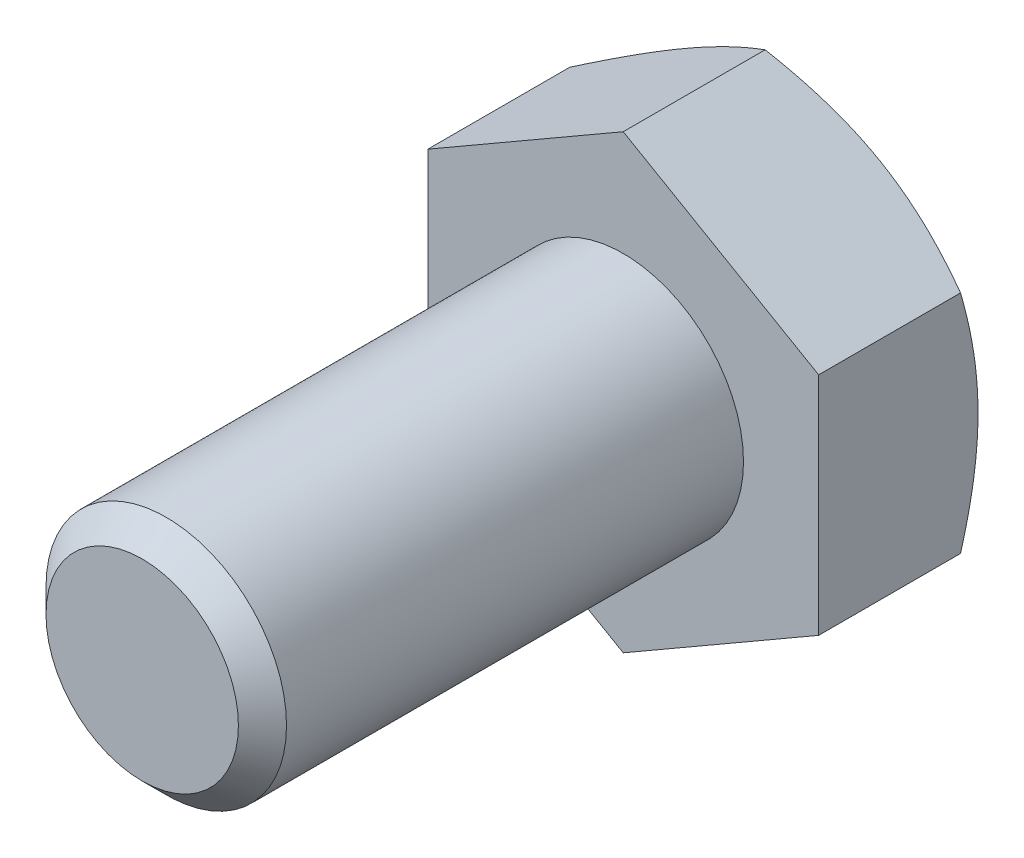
ISO-10303-21;
HEADER;
FILE_DESCRIPTION(('STEP AP214'),'2;1');
FILE_NAME('part.step','',(''),(''),'','','');
FILE_SCHEMA(('AUTOMOTIVE_DESIGN { 1 0 10303 214 1 1 1 1 }'));
ENDSEC;
DATA;
#1=APPLICATION_CONTEXT('core data for automotive mechanical design processes');
#2=APPLICATION_PROTOCOL_DEFINITION('international standard','automotive_design',2000,#1);
#3=PRODUCT_CONTEXT('',#1,'mechanical');
#4=PRODUCT('Part','Part','',(#3));
#5=PRODUCT_RELATED_PRODUCT_CATEGORY('part','',(#4));
#6=PRODUCT_DEFINITION_FORMATION('','',#4);
#7=PRODUCT_DEFINITION_CONTEXT('part definition',#1,'design');
#8=PRODUCT_DEFINITION('design','',#6,#7);
#9=PRODUCT_DEFINITION_SHAPE('','',#8);
#10=(LENGTH_UNIT() NAMED_UNIT(*) SI_UNIT(.MILLI.,.METRE.));
#11=(NAMED_UNIT(*) PLANE_ANGLE_UNIT() SI_UNIT($,.RADIAN.));
#12=(NAMED_UNIT(*) SI_UNIT($,.STERADIAN.) SOLID_ANGLE_UNIT());
#13=UNCERTAINTY_MEASURE_WITH_UNIT(LENGTH_MEASURE(1.E-05),#10,'distance_accuracy_value','');
#14=(GEOMETRIC_REPRESENTATION_CONTEXT(3) GLOBAL_UNCERTAINTY_ASSIGNED_CONTEXT((#13)) GLOBAL_UNIT_ASSIGNED_CONTEXT((#10,
#11,#12)) REPRESENTATION_CONTEXT('',''));
#15=CARTESIAN_POINT('',(0.,0.,0.));
#16=DIRECTION('',(0.,0.,1.));
#17=DIRECTION('',(1.,0.,0.));
#18=AXIS2_PLACEMENT_3D('',#15,#16,#17);
#19=CARTESIAN_POINT('',(0.,0.,16.));
#20=DIRECTION('',(0.,0.,1.));
#21=DIRECTION('',(1.,0.,0.));
#22=AXIS2_PLACEMENT_3D('',#19,#20,#21);
#23=PLANE('',#22);
#24=CARTESIAN_POINT('',(0.,0.,16.));
#25=DIRECTION('',(0.,0.,1.));
#26=DIRECTION('',(1.,0.,0.));
#27=AXIS2_PLACEMENT_3D('',#24,#25,#26);
#28=CIRCLE('',#27,3.2);
#29=CARTESIAN_POINT('',(3.2,0.,16.));
#30=VERTEX_POINT('',#29);
#31=EDGE_CURVE('E203',#30,#30,#28,.T.);
#32=ORIENTED_EDGE('',*,*,#31,.T.);
#33=EDGE_LOOP('',(#32));
#34=FACE_BOUND('',#33,.T.);
#35=ADVANCED_FACE('F29',(#34),#23,.T.);
#36=CARTESIAN_POINT('',(0.,0.,0.));
#37=DIRECTION('',(0.,0.,1.));
#38=DIRECTION('',(1.,0.,0.));
#39=AXIS2_PLACEMENT_3D('',#36,#37,#38);
#40=CYLINDRICAL_SURFACE('',#39,4.);
#41=CARTESIAN_POINT('',(0.,0.,15.2));
#42=DIRECTION('',(0.,0.,1.));
#43=DIRECTION('',(1.,0.,0.));
#44=AXIS2_PLACEMENT_3D('',#41,#42,#43);
#45=CIRCLE('',#44,4.);
#46=CARTESIAN_POINT('',(4.,0.,15.2));
#47=VERTEX_POINT('',#46);
#48=EDGE_CURVE('E205',#47,#47,#45,.F.);
#49=ORIENTED_EDGE('',*,*,#48,.T.);
#50=EDGE_LOOP('',(#49));
#51=FACE_BOUND('',#50,.T.);
#52=CARTESIAN_POINT('',(0.,0.,0.));
#53=DIRECTION('',(0.,0.,1.));
#54=DIRECTION('',(1.,0.,0.));
#55=AXIS2_PLACEMENT_3D('',#52,#53,#54);
#56=CIRCLE('',#55,4.);
#57=CARTESIAN_POINT('',(4.,0.,0.));
#58=VERTEX_POINT('',#57);
#59=EDGE_CURVE('E206',#58,#58,#56,.F.);
#60=ORIENTED_EDGE('',*,*,#59,.F.);
#61=EDGE_LOOP('',(#60));
#62=FACE_BOUND('',#61,.T.);
#63=ADVANCED_FACE('F194',(#51,#62),#40,.T.);
#64=CARTESIAN_POINT('',(0.,0.,16.));
#65=DIRECTION('',(0.,0.,-1.));
#66=DIRECTION('',(-1.,0.,0.));
#67=AXIS2_PLACEMENT_3D('',#64,#65,#66);
#68=CONICAL_SURFACE('',#67,3.2,0.785398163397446);
#69=ORIENTED_EDGE('',*,*,#48,.F.);
#70=EDGE_LOOP('',(#69));
#71=FACE_BOUND('',#70,.T.);
#72=ORIENTED_EDGE('',*,*,#31,.F.);
#73=EDGE_LOOP('',(#72));
#74=FACE_BOUND('',#73,.T.);
#75=ADVANCED_FACE('F199',(#71,#74),#68,.T.);
#76=CARTESIAN_POINT('',(0.,7.50555349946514,-5.3));
#77=DIRECTION('',(0.499999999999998,0.86602540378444,0.));
#78=DIRECTION('',(-0.86602540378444,0.499999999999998,0.));
#79=AXIS2_PLACEMENT_3D('',#76,#77,#78);
#80=PLANE('',#79);
#81=CARTESIAN_POINT('',(-0.000200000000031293,7.50566896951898,-4.71937674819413));
#82=CARTESIAN_POINT('',(0.142677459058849,7.42317863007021,-4.76699557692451));
#83=CARTESIAN_POINT('',(0.286087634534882,7.34038072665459,-4.81245329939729));
#84=CARTESIAN_POINT('',(0.574072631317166,7.17411251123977,-4.89845131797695));
#85=CARTESIAN_POINT('',(0.718647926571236,7.09064192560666,-4.93898949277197));
#86=CARTESIAN_POINT('',(1.15468865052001,6.8388936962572,-5.05242899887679));
#87=CARTESIAN_POINT('',(1.44787528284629,6.66962231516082,-5.11695219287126));
#88=CARTESIAN_POINT('',(1.88662374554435,6.41631077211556,-5.19261341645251));
#89=CARTESIAN_POINT('',(2.03087463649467,6.33302748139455,-5.21416714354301));
#90=CARTESIAN_POINT('',(2.32002821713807,6.16608458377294,-5.25030968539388));
#91=CARTESIAN_POINT('',(2.46493084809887,6.08242501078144,-5.26489911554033));
#92=CARTESIAN_POINT('',(2.7549877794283,5.91496056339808,-5.28674124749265));
#93=CARTESIAN_POINT('',(2.90014160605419,5.83115596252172,-5.29400227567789));
#94=CARTESIAN_POINT('',(3.19057533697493,5.66347396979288,-5.30103969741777));
#95=CARTESIAN_POINT('',(3.33585523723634,5.57959658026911,-5.3008163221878));
#96=CARTESIAN_POINT('',(3.73387594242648,5.34979921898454,-5.28991654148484));
#97=CARTESIAN_POINT('',(3.98648646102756,5.20395446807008,-5.27161818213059));
#98=CARTESIAN_POINT('',(4.49002967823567,4.91323365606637,-5.21359365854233));
#99=CARTESIAN_POINT('',(4.74096060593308,4.76835861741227,-5.17384766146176));
#100=CARTESIAN_POINT('',(5.24551722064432,4.47705272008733,-5.07449409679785));
#101=CARTESIAN_POINT('',(5.49907924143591,4.33065861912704,-5.01446557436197));
#102=CARTESIAN_POINT('',(6.00242193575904,4.04005357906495,-4.87822500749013));
#103=CARTESIAN_POINT('',(6.25220905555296,3.89583891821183,-4.8020449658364));
#104=CARTESIAN_POINT('',(6.5002,3.75266127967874,-4.71937674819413));
#105=B_SPLINE_CURVE_WITH_KNOTS('',3,(#81,#82,#83,#84,#85,#86,#87,#88,#89,#90,#91,#92,#93,#94,
#95,#96,#97,#98,#99,#100,#101,#102,#103,#104),.UNSPECIFIED.,.F.,.F.,(4,2,2,2,2,2,2,2,2,2,2,4),
(0.,0.515105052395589,1.03043143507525,2.06322554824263,2.56697389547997,3.07067772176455,
3.57380860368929,4.07692394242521,4.95279354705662,5.82947446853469,6.72559912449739,
7.61996451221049),.UNSPECIFIED.);
#106=CARTESIAN_POINT('',(0.,7.50555349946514,-4.71944341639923));
#107=VERTEX_POINT('',#106);
#108=CARTESIAN_POINT('',(3.24999999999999,5.62916512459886,-5.3));
#109=VERTEX_POINT('',#108);
#110=EDGE_CURVE('E239',#107,#109,#105,.T.);
#111=ORIENTED_EDGE('',*,*,#110,.F.);
#112=DIRECTION('',(0.,0.,1.));
#113=VECTOR('',#112,1.);
#114=CARTESIAN_POINT('',(0.,7.50555349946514,-5.3));
#115=LINE('',#114,#113);
#116=CARTESIAN_POINT('',(0.,7.50555349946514,0.));
#117=VERTEX_POINT('',#116);
#118=EDGE_CURVE('E213',#107,#117,#115,.T.);
#119=ORIENTED_EDGE('',*,*,#118,.T.);
#120=DIRECTION('',(-0.86602540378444,0.499999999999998,0.));
#121=VECTOR('',#120,1.);
#122=CARTESIAN_POINT('',(0.,7.50555349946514,0.));
#123=LINE('',#122,#121);
#124=CARTESIAN_POINT('',(6.5,3.75277674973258,0.));
#125=VERTEX_POINT('',#124);
#126=EDGE_CURVE('E237',#125,#117,#123,.T.);
#127=ORIENTED_EDGE('',*,*,#126,.F.);
#128=DIRECTION('',(0.,0.,1.));
#129=VECTOR('',#128,1.);
#130=CARTESIAN_POINT('',(6.5,3.75277674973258,-5.3));
#131=LINE('',#130,#129);
#132=CARTESIAN_POINT('',(6.5,3.75277674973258,-4.71944341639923));
#133=VERTEX_POINT('',#132);
#134=EDGE_CURVE('E210',#133,#125,#131,.T.);
#135=ORIENTED_EDGE('',*,*,#134,.F.);
#136=EDGE_CURVE('E169',#109,#133,#105,.T.);
#137=ORIENTED_EDGE('',*,*,#136,.F.);
#138=EDGE_LOOP('',(#111,#119,#127,#135,#137));
#139=FACE_BOUND('',#138,.T.);
#140=ADVANCED_FACE('F179',(#139),#80,.T.);
#141=CARTESIAN_POINT('',(6.5,-3.75277674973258,-5.3));
#142=DIRECTION('',(1.,0.,0.));
#143=DIRECTION('',(0.,0.,-1.));
#144=AXIS2_PLACEMENT_3D('',#141,#142,#143);
#145=PLANE('',#144);
#146=CARTESIAN_POINT('',(6.5,-10.2428264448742,-2.04883753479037));
#147=CARTESIAN_POINT('',(6.5,-9.95749123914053,-2.18789595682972));
#148=CARTESIAN_POINT('',(6.5,-9.67151814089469,-2.32566707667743));
#149=CARTESIAN_POINT('',(6.5,-9.09795746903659,-2.59791370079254));
#150=CARTESIAN_POINT('',(6.5,-8.81036966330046,-2.73238871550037));
#151=CARTESIAN_POINT('',(6.5,-8.23183597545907,-2.99796413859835));
#152=CARTESIAN_POINT('',(6.5,-7.94088042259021,-3.12904355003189));
#153=CARTESIAN_POINT('',(6.5,-7.35671087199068,-3.38604980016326));
#154=CARTESIAN_POINT('',(6.5,-7.06349697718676,-3.51197687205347));
#155=CARTESIAN_POINT('',(6.5,-6.46434920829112,-3.7614858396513));
#156=CARTESIAN_POINT('',(6.5,-6.15832132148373,-3.88484316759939));
#157=CARTESIAN_POINT('',(6.5,-5.54274557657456,-4.12260875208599));
#158=CARTESIAN_POINT('',(6.5,-5.23319733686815,-4.2370160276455));
#159=CARTESIAN_POINT('',(6.5,-4.61061796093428,-4.45399730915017));
#160=CARTESIAN_POINT('',(6.5,-4.29759477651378,-4.55659391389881));
#161=CARTESIAN_POINT('',(6.5,-3.66705774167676,-4.74676876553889));
#162=CARTESIAN_POINT('',(6.5,-3.34954528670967,-4.83435157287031));
#163=CARTESIAN_POINT('',(6.5,-2.71162315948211,-4.98994277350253));
#164=CARTESIAN_POINT('',(6.5,-2.3912406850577,-5.05806094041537));
#165=CARTESIAN_POINT('',(6.5,-1.74628166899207,-5.17096432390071));
#166=CARTESIAN_POINT('',(6.5,-1.4217055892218,-5.21575208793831));
#167=CARTESIAN_POINT('',(6.5,-0.935153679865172,-5.26247031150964));
#168=CARTESIAN_POINT('',(6.5,-0.77412070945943,-5.27461755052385));
#169=CARTESIAN_POINT('',(6.5,-0.451677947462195,-5.29209027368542));
#170=CARTESIAN_POINT('',(6.5,-0.290268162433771,-5.29741587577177));
#171=CARTESIAN_POINT('',(6.5,0.0326315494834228,-5.30111032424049));
#172=CARTESIAN_POINT('',(6.5,0.194121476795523,-5.29947913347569));
#173=CARTESIAN_POINT('',(6.5,0.51688566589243,-5.28930353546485));
#174=CARTESIAN_POINT('',(6.5,0.678159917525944,-5.2807588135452));
#175=CARTESIAN_POINT('',(6.5,1.06087214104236,-5.25246253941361));
#176=CARTESIAN_POINT('',(6.5,1.28209274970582,-5.22970222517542));
#177=CARTESIAN_POINT('',(6.5,1.72298724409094,-5.17237790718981));
#178=CARTESIAN_POINT('',(6.5,1.94266093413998,-5.13781243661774));
#179=CARTESIAN_POINT('',(6.5,2.59905068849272,-5.01823337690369));
#180=CARTESIAN_POINT('',(6.5,3.03292018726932,-4.91735524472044));
#181=CARTESIAN_POINT('',(6.5,3.68203059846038,-4.74117763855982));
#182=CARTESIAN_POINT('',(6.5,3.90060192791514,-4.67743243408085));
#183=CARTESIAN_POINT('',(6.5,4.33562456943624,-4.54301317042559));
#184=CARTESIAN_POINT('',(6.5,4.55207586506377,-4.47233905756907));
#185=CARTESIAN_POINT('',(6.5,4.98292314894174,-4.3252213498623));
#186=CARTESIAN_POINT('',(6.5,5.19731969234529,-4.24877936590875));
#187=CARTESIAN_POINT('',(6.5,5.62431367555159,-4.09105605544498));
#188=CARTESIAN_POINT('',(6.5,5.8369111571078,-4.00977484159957));
#189=CARTESIAN_POINT('',(6.5,6.41107024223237,-3.78396124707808));
#190=CARTESIAN_POINT('',(6.5,6.77109993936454,-3.63553740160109));
#191=CARTESIAN_POINT('',(6.5,7.48742894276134,-3.32991367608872));
#192=CARTESIAN_POINT('',(6.5,7.84372782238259,-3.17271280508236));
#193=CARTESIAN_POINT('',(6.5,8.55345570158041,-2.85162072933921));
#194=CARTESIAN_POINT('',(6.5,8.90688352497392,-2.68772693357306));
#195=CARTESIAN_POINT('',(6.5,9.61131133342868,-2.35485675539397));
#196=CARTESIAN_POINT('',(6.5,9.96231141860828,-2.18588058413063));
#197=CARTESIAN_POINT('',(6.5,10.6629371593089,-1.84367823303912));
#198=CARTESIAN_POINT('',(6.5,11.0125596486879,-1.67044558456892));
#199=CARTESIAN_POINT('',(6.5,11.7102232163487,-1.32082260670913));
#200=CARTESIAN_POINT('',(6.5,12.058264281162,-1.14443225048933));
#201=CARTESIAN_POINT('',(6.5,12.7529700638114,-0.78915631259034));
#202=CARTESIAN_POINT('',(6.5,13.099635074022,-0.610271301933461));
#203=CARTESIAN_POINT('',(6.5,13.7918918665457,-0.250435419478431));
#204=CARTESIAN_POINT('',(6.5,14.1374836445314,-0.0694845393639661));
#205=CARTESIAN_POINT('',(6.5,15.099399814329,0.437179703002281));
#206=CARTESIAN_POINT('',(6.5,15.7147468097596,0.764748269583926));
#207=CARTESIAN_POINT('',(6.5,16.9433793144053,1.42381233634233));
#208=CARTESIAN_POINT('',(6.5,17.5566646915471,1.75530808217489));
#209=CARTESIAN_POINT('',(6.5,18.7795711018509,2.42008717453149));
#210=CARTESIAN_POINT('',(6.5,19.389197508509,2.75336064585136));
#211=CARTESIAN_POINT('',(6.5,20.6071616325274,3.42213981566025));
#212=CARTESIAN_POINT('',(6.5,21.2154994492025,3.75764533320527));
#213=CARTESIAN_POINT('',(6.5,21.8233856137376,4.09396124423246));
#214=B_SPLINE_CURVE_WITH_KNOTS('',3,(#146,#147,#148,#149,#150,#151,#152,#153,#154,#155,#156,
#157,#158,#159,#160,#161,#162,#163,#164,#165,#166,#167,#168,#169,#170,#171,#172,#173,#174,#175,
#176,#177,#178,#179,#180,#181,#182,#183,#184,#185,#186,#187,#188,#189,#190,#191,#192,#193,#194,
#195,#196,#197,#198,#199,#200,#201,#202,#203,#204,#205,#206,#207,#208,#209,#210,#211,#212,#213),
.UNSPECIFIED.,.F.,.F.,(4,2,2,2,2,2,2,2,2,2,2,2,2,2,2,2,2,2,2,2,2,2,2,2,2,2,2,2,2,2,2,2,2,4),(0.,
0.952261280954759,1.90466315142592,2.8619801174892,3.81925370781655,4.8090096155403,
5.798873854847,6.78681142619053,7.7744483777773,8.75640022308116,9.73824482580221,
10.2225937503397,10.7069343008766,11.1912774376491,11.6756426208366,12.3424346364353,
13.0093095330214,14.3437044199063,15.0266742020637,15.7096492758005,16.3924343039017,
17.0752034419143,18.2433007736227,19.4115302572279,20.580216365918,21.748853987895,
22.9193933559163,24.0899426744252,25.2602283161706,26.4305186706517,28.5218066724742,
30.6132261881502,32.6975528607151,34.7817125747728),.UNSPECIFIED.);
#215=CARTESIAN_POINT('',(6.5,0.,-5.3));
#216=VERTEX_POINT('',#215);
#217=EDGE_CURVE('E167',#133,#216,#214,.F.);
#218=ORIENTED_EDGE('',*,*,#217,.F.);
#219=ORIENTED_EDGE('',*,*,#134,.T.);
#220=DIRECTION('',(0.,1.,0.));
#221=VECTOR('',#220,1.);
#222=CARTESIAN_POINT('',(6.5,-3.75277674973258,0.));
#223=LINE('',#222,#221);
#224=CARTESIAN_POINT('',(6.5,-3.75277674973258,0.));
#225=VERTEX_POINT('',#224);
#226=EDGE_CURVE('E215',#225,#125,#223,.T.);
#227=ORIENTED_EDGE('',*,*,#226,.F.);
#228=DIRECTION('',(0.,0.,1.));
#229=VECTOR('',#228,1.);
#230=CARTESIAN_POINT('',(6.5,-3.75277674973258,-5.3));
#231=LINE('',#230,#229);
#232=CARTESIAN_POINT('',(6.5,-3.75277674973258,-4.71944341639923));
#233=VERTEX_POINT('',#232);
#234=EDGE_CURVE('E221',#233,#225,#231,.T.);
#235=ORIENTED_EDGE('',*,*,#234,.F.);
#236=EDGE_CURVE('E162',#216,#233,#214,.F.);
#237=ORIENTED_EDGE('',*,*,#236,.F.);
#238=EDGE_LOOP('',(#218,#219,#227,#235,#237));
#239=FACE_BOUND('',#238,.T.);
#240=ADVANCED_FACE('F175',(#239),#145,.T.);
#241=CARTESIAN_POINT('',(0.,-7.50555349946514,-5.3));
#242=DIRECTION('',(0.499999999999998,-0.86602540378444,0.));
#243=DIRECTION('',(0.86602540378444,0.499999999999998,0.));
#244=AXIS2_PLACEMENT_3D('',#241,#242,#243);
#245=PLANE('',#244);
#246=CARTESIAN_POINT('',(6.5002,-3.75266127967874,-4.71937674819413));
#247=CARTESIAN_POINT('',(6.35732254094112,-3.83515161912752,-4.76699557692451));
#248=CARTESIAN_POINT('',(6.21391236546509,-3.91794952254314,-4.81245329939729));
#249=CARTESIAN_POINT('',(5.92592736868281,-4.08421773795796,-4.89845131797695));
#250=CARTESIAN_POINT('',(5.78135207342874,-4.16768832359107,-4.93898949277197));
#251=CARTESIAN_POINT('',(5.34531134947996,-4.41943655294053,-5.05242899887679));
#252=CARTESIAN_POINT('',(5.05212471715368,-4.58870793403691,-5.11695219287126));
#253=CARTESIAN_POINT('',(4.61337625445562,-4.84201947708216,-5.19261341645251));
#254=CARTESIAN_POINT('',(4.4691253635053,-4.92530276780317,-5.21416714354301));
#255=CARTESIAN_POINT('',(4.1799717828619,-5.09224566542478,-5.25030968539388));
#256=CARTESIAN_POINT('',(4.0350691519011,-5.17590523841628,-5.26489911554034));
#257=CARTESIAN_POINT('',(3.74501222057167,-5.34336968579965,-5.28674124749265));
#258=CARTESIAN_POINT('',(3.59985839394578,-5.42717428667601,-5.29400227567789));
#259=CARTESIAN_POINT('',(3.30942466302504,-5.59485627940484,-5.30103969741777));
#260=CARTESIAN_POINT('',(3.16414476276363,-5.67873366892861,-5.3008163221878));
#261=CARTESIAN_POINT('',(2.76612405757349,-5.90853103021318,-5.28991654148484));
#262=CARTESIAN_POINT('',(2.51351353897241,-6.05437578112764,-5.27161818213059));
#263=CARTESIAN_POINT('',(2.0099703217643,-6.34509659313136,-5.21359365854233));
#264=CARTESIAN_POINT('',(1.7590393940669,-6.48997163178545,-5.17384766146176));
#265=CARTESIAN_POINT('',(1.25448277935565,-6.78127752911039,-5.07449409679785));
#266=CARTESIAN_POINT('',(1.00092075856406,-6.92767163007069,-5.01446557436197));
#267=CARTESIAN_POINT('',(0.497578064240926,-7.21827667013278,-4.87822500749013));
#268=CARTESIAN_POINT('',(0.247790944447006,-7.3624913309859,-4.8020449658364));
#269=CARTESIAN_POINT('',(-0.000200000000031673,-7.50566896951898,-4.71937674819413));
#270=B_SPLINE_CURVE_WITH_KNOTS('',3,(#246,#247,#248,#249,#250,#251,#252,#253,#254,#255,#256,
#257,#258,#259,#260,#261,#262,#263,#264,#265,#266,#267,#268,#269),.UNSPECIFIED.,.F.,.F.,(4,2,2,
2,2,2,2,2,2,2,2,4),(0.,0.515105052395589,1.03043143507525,2.06322554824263,2.56697389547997,
3.07067772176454,3.57380860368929,4.07692394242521,4.95279354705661,5.82947446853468,
6.72559912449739,7.61996451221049),.UNSPECIFIED.);
#271=CARTESIAN_POINT('',(3.24999999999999,-5.62916512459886,-5.3));
#272=VERTEX_POINT('',#271);
#273=EDGE_CURVE('E168',#233,#272,#270,.T.);
#274=ORIENTED_EDGE('',*,*,#273,.F.);
#275=ORIENTED_EDGE('',*,*,#234,.T.);
#276=DIRECTION('',(0.86602540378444,0.499999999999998,0.));
#277=VECTOR('',#276,1.);
#278=CARTESIAN_POINT('',(0.,-7.50555349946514,0.));
#279=LINE('',#278,#277);
#280=CARTESIAN_POINT('',(0.,-7.50555349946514,0.));
#281=VERTEX_POINT('',#280);
#282=EDGE_CURVE('E226',#281,#225,#279,.T.);
#283=ORIENTED_EDGE('',*,*,#282,.F.);
#284=DIRECTION('',(0.,0.,1.));
#285=VECTOR('',#284,1.);
#286=CARTESIAN_POINT('',(0.,-7.50555349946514,-5.3));
#287=LINE('',#286,#285);
#288=CARTESIAN_POINT('',(0.,-7.50555349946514,-4.71944341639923));
#289=VERTEX_POINT('',#288);
#290=EDGE_CURVE('E219',#289,#281,#287,.T.);
#291=ORIENTED_EDGE('',*,*,#290,.F.);
#292=EDGE_CURVE('E156',#272,#289,#270,.T.);
#293=ORIENTED_EDGE('',*,*,#292,.F.);
#294=EDGE_LOOP('',(#274,#275,#283,#291,#293));
#295=FACE_BOUND('',#294,.T.);
#296=ADVANCED_FACE('F178',(#295),#245,.T.);
#297=CARTESIAN_POINT('',(0.,-7.50555349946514,-5.3));
#298=DIRECTION('',(-0.500000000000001,-0.866025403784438,0.));
#299=DIRECTION('',(0.866025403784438,-0.500000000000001,0.));
#300=AXIS2_PLACEMENT_3D('',#297,#298,#299);
#301=PLANE('',#300);
#302=CARTESIAN_POINT('',(0.000199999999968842,-7.50566896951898,-4.71937674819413));
#303=CARTESIAN_POINT('',(-0.142677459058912,-7.42317863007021,-4.76699557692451));
#304=CARTESIAN_POINT('',(-0.286087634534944,-7.34038072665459,-4.81245329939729));
#305=CARTESIAN_POINT('',(-0.574072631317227,-7.17411251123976,-4.89845131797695));
#306=CARTESIAN_POINT('',(-0.718647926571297,-7.09064192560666,-4.93898949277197));
#307=CARTESIAN_POINT('',(-1.15468865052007,-6.83889369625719,-5.05242899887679));
#308=CARTESIAN_POINT('',(-1.44787528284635,-6.66962231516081,-5.11695219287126));
#309=CARTESIAN_POINT('',(-1.88662374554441,-6.41631077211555,-5.1926134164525));
#310=CARTESIAN_POINT('',(-2.03087463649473,-6.33302748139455,-5.21416714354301));
#311=CARTESIAN_POINT('',(-2.32002821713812,-6.16608458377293,-5.25030968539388));
#312=CARTESIAN_POINT('',(-2.46493084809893,-6.08242501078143,-5.26489911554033));
#313=CARTESIAN_POINT('',(-2.75498777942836,-5.91496056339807,-5.28674124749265));
#314=CARTESIAN_POINT('',(-2.90014160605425,-5.8311559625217,-5.29400227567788));
#315=CARTESIAN_POINT('',(-3.19057533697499,-5.66347396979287,-5.30103969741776));
#316=CARTESIAN_POINT('',(-3.3358552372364,-5.5795965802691,-5.30081632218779));
#317=CARTESIAN_POINT('',(-3.73387594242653,-5.34979921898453,-5.28991654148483));
#318=CARTESIAN_POINT('',(-3.9864864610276,-5.20395446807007,-5.27161818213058));
#319=CARTESIAN_POINT('',(-4.49002967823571,-4.91323365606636,-5.21359365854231));
#320=CARTESIAN_POINT('',(-4.74096060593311,-4.76835861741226,-5.17384766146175));
#321=CARTESIAN_POINT('',(-5.24551722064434,-4.47705272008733,-5.07449409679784));
#322=CARTESIAN_POINT('',(-5.49907924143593,-4.33065861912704,-5.01446557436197));
#323=CARTESIAN_POINT('',(-6.00242193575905,-4.04005357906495,-4.87822500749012));
#324=CARTESIAN_POINT('',(-6.25220905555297,-3.89583891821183,-4.8020449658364));
#325=CARTESIAN_POINT('',(-6.5002,-3.75266127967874,-4.71937674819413));
#326=B_SPLINE_CURVE_WITH_KNOTS('',3,(#302,#303,#304,#305,#306,#307,#308,#309,#310,#311,#312,
#313,#314,#315,#316,#317,#318,#319,#320,#321,#322,#323,#324,#325),.UNSPECIFIED.,.F.,.F.,(4,2,2,
2,2,2,2,2,2,2,2,4),(0.,0.515105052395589,1.03043143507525,2.06322554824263,2.56697389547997,
3.07067772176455,3.57380860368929,4.07692394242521,4.9527935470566,5.82947446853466,
6.72559912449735,7.61996451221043),.UNSPECIFIED.);
#327=CARTESIAN_POINT('',(-3.25000000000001,-5.62916512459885,-5.3));
#328=VERTEX_POINT('',#327);
#329=EDGE_CURVE('E258',#289,#328,#326,.T.);
#330=ORIENTED_EDGE('',*,*,#329,.F.);
#331=ORIENTED_EDGE('',*,*,#290,.T.);
#332=DIRECTION('',(0.866025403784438,-0.500000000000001,0.));
#333=VECTOR('',#332,1.);
#334=CARTESIAN_POINT('',(0.,-7.50555349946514,0.));
#335=LINE('',#334,#333);
#336=CARTESIAN_POINT('',(-6.5,-3.75277674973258,0.));
#337=VERTEX_POINT('',#336);
#338=EDGE_CURVE('E229',#337,#281,#335,.T.);
#339=ORIENTED_EDGE('',*,*,#338,.F.);
#340=DIRECTION('',(0.,0.,1.));
#341=VECTOR('',#340,1.);
#342=CARTESIAN_POINT('',(-6.5,-3.75277674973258,-5.3));
#343=LINE('',#342,#341);
#344=CARTESIAN_POINT('',(-6.5,-3.75277674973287,-4.71944341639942));
#345=VERTEX_POINT('',#344);
#346=EDGE_CURVE('E217',#345,#337,#343,.T.);
#347=ORIENTED_EDGE('',*,*,#346,.F.);
#348=EDGE_CURVE('E105',#328,#345,#326,.T.);
#349=ORIENTED_EDGE('',*,*,#348,.F.);
#350=EDGE_LOOP('',(#330,#331,#339,#347,#349));
#351=FACE_BOUND('',#350,.T.);
#352=ADVANCED_FACE('F183',(#351),#301,.T.);
#353=CARTESIAN_POINT('',(-6.5,-3.75277674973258,-5.3));
#354=DIRECTION('',(-1.,0.,0.));
#355=DIRECTION('',(0.,0.,1.));
#356=AXIS2_PLACEMENT_3D('',#353,#354,#355);
#357=PLANE('',#356);
#358=CARTESIAN_POINT('',(-6.5,-10.2428264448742,-2.04883753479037));
#359=CARTESIAN_POINT('',(-6.5,-9.95749123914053,-2.18789595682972));
#360=CARTESIAN_POINT('',(-6.5,-9.67151814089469,-2.32566707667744));
#361=CARTESIAN_POINT('',(-6.5,-9.09795746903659,-2.59791370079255));
#362=CARTESIAN_POINT('',(-6.5,-8.81036966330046,-2.73238871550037));
#363=CARTESIAN_POINT('',(-6.5,-8.23183597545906,-2.99796413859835));
#364=CARTESIAN_POINT('',(-6.5,-7.94088042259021,-3.12904355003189));
#365=CARTESIAN_POINT('',(-6.5,-7.35671087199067,-3.38604980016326));
#366=CARTESIAN_POINT('',(-6.5,-7.06349697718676,-3.51197687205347));
#367=CARTESIAN_POINT('',(-6.5,-6.46434920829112,-3.7614858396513));
#368=CARTESIAN_POINT('',(-6.5,-6.15832132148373,-3.8848431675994));
#369=CARTESIAN_POINT('',(-6.5,-5.54274557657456,-4.12260875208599));
#370=CARTESIAN_POINT('',(-6.5,-5.23319733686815,-4.2370160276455));
#371=CARTESIAN_POINT('',(-6.5,-4.61061796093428,-4.45399730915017));
#372=CARTESIAN_POINT('',(-6.5,-4.29759477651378,-4.55659391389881));
#373=CARTESIAN_POINT('',(-6.5,-3.66705774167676,-4.74676876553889));
#374=CARTESIAN_POINT('',(-6.5,-3.34954528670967,-4.83435157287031));
#375=CARTESIAN_POINT('',(-6.5,-2.71162315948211,-4.98994277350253));
#376=CARTESIAN_POINT('',(-6.5,-2.3912406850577,-5.05806094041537));
#377=CARTESIAN_POINT('',(-6.5,-1.74628166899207,-5.17096432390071));
#378=CARTESIAN_POINT('',(-6.5,-1.4217055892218,-5.21575208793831));
#379=CARTESIAN_POINT('',(-6.5,-0.935153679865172,-5.26247031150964));
#380=CARTESIAN_POINT('',(-6.5,-0.774120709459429,-5.27461755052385));
#381=CARTESIAN_POINT('',(-6.5,-0.451677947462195,-5.29209027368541));
#382=CARTESIAN_POINT('',(-6.5,-0.290268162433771,-5.29741587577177));
#383=CARTESIAN_POINT('',(-6.5,0.0326315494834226,-5.30111032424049));
#384=CARTESIAN_POINT('',(-6.5,0.194121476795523,-5.29947913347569));
#385=CARTESIAN_POINT('',(-6.5,0.51688566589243,-5.28930353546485));
#386=CARTESIAN_POINT('',(-6.5,0.678159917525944,-5.2807588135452));
#387=CARTESIAN_POINT('',(-6.5,1.06087214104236,-5.25246253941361));
#388=CARTESIAN_POINT('',(-6.5,1.28209274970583,-5.22970222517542));
#389=CARTESIAN_POINT('',(-6.5,1.72298724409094,-5.17237790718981));
#390=CARTESIAN_POINT('',(-6.5,1.94266093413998,-5.13781243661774));
#391=CARTESIAN_POINT('',(-6.5,2.59905068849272,-5.01823337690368));
#392=CARTESIAN_POINT('',(-6.5,3.03292018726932,-4.91735524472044));
#393=CARTESIAN_POINT('',(-6.5,3.68203059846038,-4.74117763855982));
#394=CARTESIAN_POINT('',(-6.5,3.90060192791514,-4.67743243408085));
#395=CARTESIAN_POINT('',(-6.5,4.33562456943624,-4.54301317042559));
#396=CARTESIAN_POINT('',(-6.5,4.55207586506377,-4.47233905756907));
#397=CARTESIAN_POINT('',(-6.5,4.98292314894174,-4.3252213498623));
#398=CARTESIAN_POINT('',(-6.5,5.19731969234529,-4.24877936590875));
#399=CARTESIAN_POINT('',(-6.5,5.62431367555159,-4.09105605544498));
#400=CARTESIAN_POINT('',(-6.5,5.8369111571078,-4.00977484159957));
#401=CARTESIAN_POINT('',(-6.5,6.41107024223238,-3.78396124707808));
#402=CARTESIAN_POINT('',(-6.5,6.77109993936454,-3.63553740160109));
#403=CARTESIAN_POINT('',(-6.5,7.48742894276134,-3.32991367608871));
#404=CARTESIAN_POINT('',(-6.5,7.8437278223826,-3.17271280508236));
#405=CARTESIAN_POINT('',(-6.5,8.55345570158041,-2.85162072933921));
#406=CARTESIAN_POINT('',(-6.5,8.90688352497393,-2.68772693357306));
#407=CARTESIAN_POINT('',(-6.5,9.61131133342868,-2.35485675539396));
#408=CARTESIAN_POINT('',(-6.5,9.96231141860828,-2.18588058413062));
#409=CARTESIAN_POINT('',(-6.5,10.6629371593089,-1.84367823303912));
#410=CARTESIAN_POINT('',(-6.5,11.0125596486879,-1.67044558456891));
#411=CARTESIAN_POINT('',(-6.5,11.7102232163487,-1.32082260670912));
#412=CARTESIAN_POINT('',(-6.5,12.058264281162,-1.14443225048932));
#413=CARTESIAN_POINT('',(-6.5,12.7529700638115,-0.789156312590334));
#414=CARTESIAN_POINT('',(-6.5,13.099635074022,-0.610271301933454));
#415=CARTESIAN_POINT('',(-6.5,13.7918918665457,-0.250435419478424));
#416=CARTESIAN_POINT('',(-6.5,14.1374836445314,-0.0694845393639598));
#417=CARTESIAN_POINT('',(-6.5,15.099399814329,0.437179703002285));
#418=CARTESIAN_POINT('',(-6.5,15.7147468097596,0.76474826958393));
#419=CARTESIAN_POINT('',(-6.5,16.9433793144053,1.42381233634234));
#420=CARTESIAN_POINT('',(-6.5,17.5566646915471,1.7553080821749));
#421=CARTESIAN_POINT('',(-6.5,18.7795711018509,2.4200871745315));
#422=CARTESIAN_POINT('',(-6.5,19.389197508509,2.75336064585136));
#423=CARTESIAN_POINT('',(-6.5,20.6071616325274,3.42213981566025));
#424=CARTESIAN_POINT('',(-6.5,21.2154994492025,3.75764533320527));
#425=CARTESIAN_POINT('',(-6.5,21.8233856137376,4.09396124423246));
#426=B_SPLINE_CURVE_WITH_KNOTS('',3,(#358,#359,#360,#361,#362,#363,#364,#365,#366,#367,#368,
#369,#370,#371,#372,#373,#374,#375,#376,#377,#378,#379,#380,#381,#382,#383,#384,#385,#386,#387,
#388,#389,#390,#391,#392,#393,#394,#395,#396,#397,#398,#399,#400,#401,#402,#403,#404,#405,#406,
#407,#408,#409,#410,#411,#412,#413,#414,#415,#416,#417,#418,#419,#420,#421,#422,#423,#424,#425),
.UNSPECIFIED.,.F.,.F.,(4,2,2,2,2,2,2,2,2,2,2,2,2,2,2,2,2,2,2,2,2,2,2,2,2,2,2,2,2,2,2,2,2,4),(0.,
0.952261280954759,1.90466315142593,2.8619801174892,3.81925370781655,4.8090096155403,
5.798873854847,6.78681142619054,7.7744483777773,8.75640022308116,9.73824482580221,
10.2225937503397,10.7069343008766,11.1912774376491,11.6756426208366,12.3424346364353,
13.0093095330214,14.3437044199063,15.0266742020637,15.7096492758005,16.3924343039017,
17.0752034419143,18.2433007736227,19.4115302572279,20.580216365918,21.748853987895,
22.9193933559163,24.0899426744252,25.2602283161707,26.4305186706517,28.5218066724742,
30.6132261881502,32.6975528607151,34.7817125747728),.UNSPECIFIED.);
#427=CARTESIAN_POINT('',(-6.5,0.,-5.3));
#428=VERTEX_POINT('',#427);
#429=EDGE_CURVE('E100',#345,#428,#426,.T.);
#430=ORIENTED_EDGE('',*,*,#429,.F.);
#431=ORIENTED_EDGE('',*,*,#346,.T.);
#432=DIRECTION('',(0.,-1.,0.));
#433=VECTOR('',#432,1.);
#434=CARTESIAN_POINT('',(-6.5,-3.75277674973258,0.));
#435=LINE('',#434,#433);
#436=CARTESIAN_POINT('',(-6.5,3.75277674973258,0.));
#437=VERTEX_POINT('',#436);
#438=EDGE_CURVE('E232',#437,#337,#435,.T.);
#439=ORIENTED_EDGE('',*,*,#438,.F.);
#440=DIRECTION('',(0.,0.,1.));
#441=VECTOR('',#440,1.);
#442=CARTESIAN_POINT('',(-6.5,3.75277674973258,-5.3));
#443=LINE('',#442,#441);
#444=CARTESIAN_POINT('',(-6.5,3.75277674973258,-4.71944341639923));
#445=VERTEX_POINT('',#444);
#446=EDGE_CURVE('E126',#445,#437,#443,.T.);
#447=ORIENTED_EDGE('',*,*,#446,.F.);
#448=EDGE_CURVE('E109',#428,#445,#426,.T.);
#449=ORIENTED_EDGE('',*,*,#448,.F.);
#450=EDGE_LOOP('',(#430,#431,#439,#447,#449));
#451=FACE_BOUND('',#450,.T.);
#452=ADVANCED_FACE('F124',(#451),#357,.T.);
#453=CARTESIAN_POINT('',(-6.5,3.75277674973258,-5.3));
#454=DIRECTION('',(-0.500000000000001,0.866025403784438,0.));
#455=DIRECTION('',(-0.866025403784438,-0.500000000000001,0.));
#456=AXIS2_PLACEMENT_3D('',#453,#454,#455);
#457=PLANE('',#456);
#458=CARTESIAN_POINT('',(-6.5002,3.75266127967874,-4.71937674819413));
#459=CARTESIAN_POINT('',(-6.35732254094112,3.83515161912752,-4.76699557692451));
#460=CARTESIAN_POINT('',(-6.21391236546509,3.91794952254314,-4.81245329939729));
#461=CARTESIAN_POINT('',(-5.92592736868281,4.08421773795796,-4.89845131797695));
#462=CARTESIAN_POINT('',(-5.78135207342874,4.16768832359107,-4.93898949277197));
#463=CARTESIAN_POINT('',(-5.34531134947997,4.41943655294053,-5.05242899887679));
#464=CARTESIAN_POINT('',(-5.05212471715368,4.58870793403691,-5.11695219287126));
#465=CARTESIAN_POINT('',(-4.61337625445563,4.84201947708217,-5.1926134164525));
#466=CARTESIAN_POINT('',(-4.46912536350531,4.92530276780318,-5.21416714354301));
#467=CARTESIAN_POINT('',(-4.17997178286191,5.09224566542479,-5.25030968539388));
#468=CARTESIAN_POINT('',(-4.03506915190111,5.17590523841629,-5.26489911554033));
#469=CARTESIAN_POINT('',(-3.74501222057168,5.34336968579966,-5.28674124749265));
#470=CARTESIAN_POINT('',(-3.59985839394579,5.42717428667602,-5.29400227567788));
#471=CARTESIAN_POINT('',(-3.30942466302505,5.59485627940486,-5.30103969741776));
#472=CARTESIAN_POINT('',(-3.16414476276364,5.67873366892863,-5.30081632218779));
#473=CARTESIAN_POINT('',(-2.76612405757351,5.90853103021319,-5.28991654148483));
#474=CARTESIAN_POINT('',(-2.51351353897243,6.05437578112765,-5.27161818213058));
#475=CARTESIAN_POINT('',(-2.00997032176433,6.34509659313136,-5.21359365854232));
#476=CARTESIAN_POINT('',(-1.75903939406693,6.48997163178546,-5.17384766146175));
#477=CARTESIAN_POINT('',(-1.25448277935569,6.7812775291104,-5.07449409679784));
#478=CARTESIAN_POINT('',(-1.00092075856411,6.92767163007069,-5.01446557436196));
#479=CARTESIAN_POINT('',(-0.497578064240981,7.21827667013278,-4.87822500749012));
#480=CARTESIAN_POINT('',(-0.247790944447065,7.3624913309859,-4.8020449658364));
#481=CARTESIAN_POINT('',(0.000199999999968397,7.50566896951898,-4.71937674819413));
#482=B_SPLINE_CURVE_WITH_KNOTS('',3,(#458,#459,#460,#461,#462,#463,#464,#465,#466,#467,#468,
#469,#470,#471,#472,#473,#474,#475,#476,#477,#478,#479,#480,#481),.UNSPECIFIED.,.F.,.F.,(4,2,2,
2,2,2,2,2,2,2,2,4),(0.,0.515105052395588,1.03043143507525,2.06322554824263,2.56697389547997,
3.07067772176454,3.57380860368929,4.07692394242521,4.9527935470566,5.82947446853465,
6.72559912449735,7.61996451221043),.UNSPECIFIED.);
#483=CARTESIAN_POINT('',(-3.25000000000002,5.62916512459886,-5.3));
#484=VERTEX_POINT('',#483);
#485=EDGE_CURVE('E115',#445,#484,#482,.T.);
#486=ORIENTED_EDGE('',*,*,#485,.F.);
#487=ORIENTED_EDGE('',*,*,#446,.T.);
#488=DIRECTION('',(-0.866025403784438,-0.500000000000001,0.));
#489=VECTOR('',#488,1.);
#490=CARTESIAN_POINT('',(-6.5,3.75277674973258,0.));
#491=LINE('',#490,#489);
#492=EDGE_CURVE('E235',#117,#437,#491,.T.);
#493=ORIENTED_EDGE('',*,*,#492,.F.);
#494=ORIENTED_EDGE('',*,*,#118,.F.);
#495=EDGE_CURVE('E117',#484,#107,#482,.T.);
#496=ORIENTED_EDGE('',*,*,#495,.F.);
#497=EDGE_LOOP('',(#486,#487,#493,#494,#496));
#498=FACE_BOUND('',#497,.T.);
#499=ADVANCED_FACE('F191',(#498),#457,.T.);
#500=CARTESIAN_POINT('',(6.5,3.75277674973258,0.));
#501=DIRECTION('',(0.,0.,1.));
#502=DIRECTION('',(1.,0.,0.));
#503=AXIS2_PLACEMENT_3D('',#500,#501,#502);
#504=PLANE('',#503);
#505=ORIENTED_EDGE('',*,*,#59,.T.);
#506=EDGE_LOOP('',(#505));
#507=FACE_BOUND('',#506,.T.);
#508=ORIENTED_EDGE('',*,*,#126,.T.);
#509=ORIENTED_EDGE('',*,*,#492,.T.);
#510=ORIENTED_EDGE('',*,*,#438,.T.);
#511=ORIENTED_EDGE('',*,*,#338,.T.);
#512=ORIENTED_EDGE('',*,*,#282,.T.);
#513=ORIENTED_EDGE('',*,*,#226,.T.);
#514=EDGE_LOOP('',(#508,#509,#510,#511,#512,#513));
#515=FACE_BOUND('',#514,.T.);
#516=ADVANCED_FACE('F148',(#507,#515),#504,.T.);
#517=CARTESIAN_POINT('',(0.,0.,0.));
#518=DIRECTION('',(0.,0.,1.));
#519=DIRECTION('',(1.,0.,0.));
#520=AXIS2_PLACEMENT_3D('',#517,#518,#519);
#521=CONICAL_SURFACE('',#520,15.679869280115,1.0471975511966);
#522=ORIENTED_EDGE('',*,*,#136,.T.);
#523=ORIENTED_EDGE('',*,*,#217,.T.);
#524=CARTESIAN_POINT('',(0.,0.,-5.3));
#525=DIRECTION('',(0.,0.,1.));
#526=DIRECTION('',(1.,0.,0.));
#527=AXIS2_PLACEMENT_3D('',#524,#525,#526);
#528=CIRCLE('',#527,6.50000000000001);
#529=EDGE_CURVE('E32',#109,#216,#528,.F.);
#530=ORIENTED_EDGE('',*,*,#529,.F.);
#531=EDGE_LOOP('',(#522,#523,#530));
#532=FACE_BOUND('',#531,.T.);
#533=ADVANCED_FACE('F248',(#532),#521,.T.);
#534=ORIENTED_EDGE('',*,*,#110,.T.);
#535=EDGE_CURVE('E122',#484,#109,#528,.F.);
#536=ORIENTED_EDGE('',*,*,#535,.F.);
#537=ORIENTED_EDGE('',*,*,#495,.T.);
#538=EDGE_LOOP('',(#534,#536,#537));
#539=FACE_BOUND('',#538,.T.);
#540=ADVANCED_FACE('F147',(#539),#521,.T.);
#541=ORIENTED_EDGE('',*,*,#448,.T.);
#542=ORIENTED_EDGE('',*,*,#485,.T.);
#543=CARTESIAN_POINT('',(0.,0.,-5.3));
#544=DIRECTION('',(0.,0.,-1.));
#545=DIRECTION('',(-1.,0.,0.));
#546=AXIS2_PLACEMENT_3D('',#543,#544,#545);
#547=CIRCLE('',#546,6.5);
#548=EDGE_CURVE('E50',#428,#484,#547,.T.);
#549=ORIENTED_EDGE('',*,*,#548,.F.);
#550=EDGE_LOOP('',(#541,#542,#549));
#551=FACE_BOUND('',#550,.T.);
#552=ADVANCED_FACE('F113',(#551),#521,.T.);
#553=ORIENTED_EDGE('',*,*,#348,.T.);
#554=ORIENTED_EDGE('',*,*,#429,.T.);
#555=EDGE_CURVE('E102',#328,#428,#528,.F.);
#556=ORIENTED_EDGE('',*,*,#555,.F.);
#557=EDGE_LOOP('',(#553,#554,#556));
#558=FACE_BOUND('',#557,.T.);
#559=ADVANCED_FACE('F101',(#558),#521,.T.);
#560=ORIENTED_EDGE('',*,*,#292,.T.);
#561=ORIENTED_EDGE('',*,*,#329,.T.);
#562=EDGE_CURVE('E37',#272,#328,#528,.F.);
#563=ORIENTED_EDGE('',*,*,#562,.F.);
#564=EDGE_LOOP('',(#560,#561,#563));
#565=FACE_BOUND('',#564,.T.);
#566=ADVANCED_FACE('F260',(#565),#521,.T.);
#567=ORIENTED_EDGE('',*,*,#236,.T.);
#568=ORIENTED_EDGE('',*,*,#273,.T.);
#569=EDGE_CURVE('E11',#216,#272,#528,.F.);
#570=ORIENTED_EDGE('',*,*,#569,.F.);
#571=EDGE_LOOP('',(#567,#568,#570));
#572=FACE_BOUND('',#571,.T.);
#573=ADVANCED_FACE('F255',(#572),#521,.T.);
#574=CARTESIAN_POINT('',(6.5,3.75277674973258,-5.3));
#575=DIRECTION('',(0.,0.,1.));
#576=DIRECTION('',(1.,0.,0.));
#577=AXIS2_PLACEMENT_3D('',#574,#575,#576);
#578=PLANE('',#577);
#579=ORIENTED_EDGE('',*,*,#529,.T.);
#580=ORIENTED_EDGE('',*,*,#569,.T.);
#581=ORIENTED_EDGE('',*,*,#562,.T.);
#582=ORIENTED_EDGE('',*,*,#555,.T.);
#583=ORIENTED_EDGE('',*,*,#548,.T.);
#584=ORIENTED_EDGE('',*,*,#535,.T.);
#585=EDGE_LOOP('',(#579,#580,#581,#582,#583,#584));
#586=FACE_BOUND('',#585,.T.);
#587=ADVANCED_FACE('F120',(#586),#578,.F.);
#588=CLOSED_SHELL('',(#35,#63,#75,#140,#240,#296,#352,#452,#499,#516,#533,#540,#552,#559,#566,
#573,#587));
#589=MANIFOLD_SOLID_BREP('B2',#588);
#590=ADVANCED_BREP_SHAPE_REPRESENTATION('',(#18,#589),#14);
#591=SHAPE_DEFINITION_REPRESENTATION(#9,#590);
ENDSEC;
END-ISO-10303-21;
